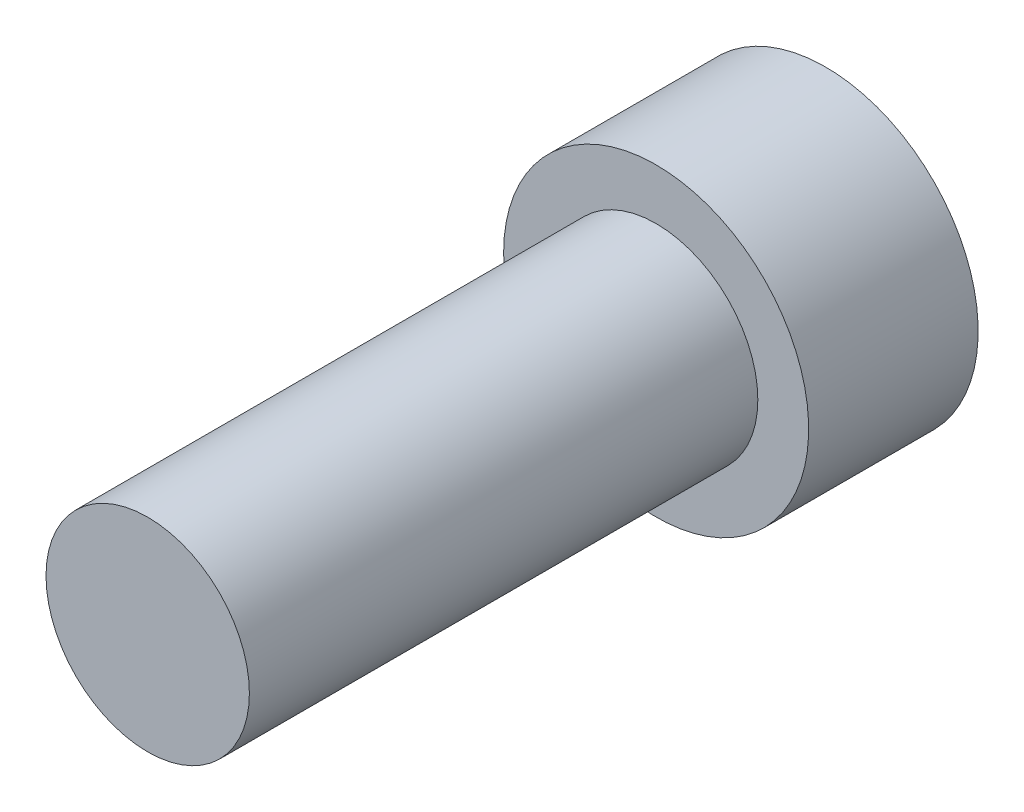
ISO-10303-21;
HEADER;
FILE_DESCRIPTION(('STEP AP214'),'2;1');
FILE_NAME('part.step','',(''),(''),'','','');
FILE_SCHEMA(('AUTOMOTIVE_DESIGN { 1 0 10303 214 1 1 1 1 }'));
ENDSEC;
DATA;
#1=APPLICATION_CONTEXT('core data for automotive mechanical design processes');
#2=APPLICATION_PROTOCOL_DEFINITION('international standard','automotive_design',2000,#1);
#3=PRODUCT_CONTEXT('',#1,'mechanical');
#4=PRODUCT('Part','Part','',(#3));
#5=PRODUCT_RELATED_PRODUCT_CATEGORY('part','',(#4));
#6=PRODUCT_DEFINITION_FORMATION('','',#4);
#7=PRODUCT_DEFINITION_CONTEXT('part definition',#1,'design');
#8=PRODUCT_DEFINITION('design','',#6,#7);
#9=PRODUCT_DEFINITION_SHAPE('','',#8);
#10=(LENGTH_UNIT() NAMED_UNIT(*) SI_UNIT(.MILLI.,.METRE.));
#11=(NAMED_UNIT(*) PLANE_ANGLE_UNIT() SI_UNIT($,.RADIAN.));
#12=(NAMED_UNIT(*) SI_UNIT($,.STERADIAN.) SOLID_ANGLE_UNIT());
#13=UNCERTAINTY_MEASURE_WITH_UNIT(LENGTH_MEASURE(1.E-05),#10,'distance_accuracy_value','');
#14=(GEOMETRIC_REPRESENTATION_CONTEXT(3) GLOBAL_UNCERTAINTY_ASSIGNED_CONTEXT((#13)) GLOBAL_UNIT_ASSIGNED_CONTEXT((#10,
#11,#12)) REPRESENTATION_CONTEXT('',''));
#15=CARTESIAN_POINT('',(0.,0.,0.));
#16=DIRECTION('',(0.,0.,1.));
#17=DIRECTION('',(1.,0.,0.));
#18=AXIS2_PLACEMENT_3D('',#15,#16,#17);
#19=CARTESIAN_POINT('',(0.,0.,-5.));
#20=DIRECTION('',(0.,0.,-1.));
#21=DIRECTION('',(-1.,0.,0.));
#22=AXIS2_PLACEMENT_3D('',#19,#20,#21);
#23=PLANE('',#22);
#24=CARTESIAN_POINT('',(0.,0.,-5.));
#25=DIRECTION('',(0.,0.,-1.));
#26=DIRECTION('',(-1.,0.,0.));
#27=AXIS2_PLACEMENT_3D('',#24,#25,#26);
#28=CIRCLE('',#27,4.5);
#29=CARTESIAN_POINT('',(-4.5,0.,-5.));
#30=VERTEX_POINT('',#29);
#31=EDGE_CURVE('E118',#30,#30,#28,.T.);
#32=ORIENTED_EDGE('',*,*,#31,.T.);
#33=EDGE_LOOP('',(#32));
#34=FACE_BOUND('',#33,.T.);
#35=DIRECTION('',(0.,-1.,0.));
#36=VECTOR('',#35,1.);
#37=CARTESIAN_POINT('',(-3.,1.73205080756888,-5.));
#38=LINE('',#37,#36);
#39=CARTESIAN_POINT('',(-3.,1.73205080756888,-5.));
#40=VERTEX_POINT('',#39);
#41=CARTESIAN_POINT('',(-3.,-1.73205080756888,-5.));
#42=VERTEX_POINT('',#41);
#43=EDGE_CURVE('E102',#40,#42,#38,.T.);
#44=ORIENTED_EDGE('',*,*,#43,.T.);
#45=DIRECTION('',(0.866025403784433,-0.50000000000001,0.));
#46=VECTOR('',#45,1.);
#47=CARTESIAN_POINT('',(-3.00000000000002,-1.73205080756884,-5.));
#48=LINE('',#47,#46);
#49=CARTESIAN_POINT('',(0.,-3.46410161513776,-5.));
#50=VERTEX_POINT('',#49);
#51=EDGE_CURVE('E85',#42,#50,#48,.T.);
#52=ORIENTED_EDGE('',*,*,#51,.T.);
#53=DIRECTION('',(0.866025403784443,0.499999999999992,0.));
#54=VECTOR('',#53,1.);
#55=CARTESIAN_POINT('',(0.,-3.46410161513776,-5.));
#56=LINE('',#55,#54);
#57=CARTESIAN_POINT('',(2.99999999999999,-1.7320508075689,-5.));
#58=VERTEX_POINT('',#57);
#59=EDGE_CURVE('E262',#50,#58,#56,.T.);
#60=ORIENTED_EDGE('',*,*,#59,.T.);
#61=DIRECTION('',(0.,1.,0.));
#62=VECTOR('',#61,1.);
#63=CARTESIAN_POINT('',(2.99999999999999,-1.7320508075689,-5.));
#64=LINE('',#63,#62);
#65=CARTESIAN_POINT('',(3.00000000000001,1.73205080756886,-5.));
#66=VERTEX_POINT('',#65);
#67=EDGE_CURVE('E264',#58,#66,#64,.T.);
#68=ORIENTED_EDGE('',*,*,#67,.T.);
#69=DIRECTION('',(-0.866025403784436,0.500000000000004,0.));
#70=VECTOR('',#69,1.);
#71=CARTESIAN_POINT('',(3.00000000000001,1.73205080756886,-5.));
#72=LINE('',#71,#70);
#73=CARTESIAN_POINT('',(0.,3.46410161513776,-5.));
#74=VERTEX_POINT('',#73);
#75=EDGE_CURVE('E275',#66,#74,#72,.T.);
#76=ORIENTED_EDGE('',*,*,#75,.T.);
#77=DIRECTION('',(-0.86602540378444,-0.499999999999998,0.));
#78=VECTOR('',#77,1.);
#79=CARTESIAN_POINT('',(0.,3.46410161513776,-5.));
#80=LINE('',#79,#78);
#81=EDGE_CURVE('E107',#74,#40,#80,.T.);
#82=ORIENTED_EDGE('',*,*,#81,.T.);
#83=EDGE_LOOP('',(#44,#52,#60,#68,#76,#82));
#84=FACE_BOUND('',#83,.T.);
#85=ADVANCED_FACE('F34',(#34,#84),#23,.T.);
#86=CARTESIAN_POINT('',(-3.,1.73205080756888,-1.));
#87=DIRECTION('',(1.,0.,0.));
#88=DIRECTION('',(0.,0.,-1.));
#89=AXIS2_PLACEMENT_3D('',#86,#87,#88);
#90=PLANE('',#89);
#91=DIRECTION('',(0.,-1.,0.));
#92=VECTOR('',#91,1.);
#93=CARTESIAN_POINT('',(-3.,1.73205080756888,-1.));
#94=LINE('',#93,#92);
#95=CARTESIAN_POINT('',(-3.,1.73205080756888,-1.));
#96=VERTEX_POINT('',#95);
#97=CARTESIAN_POINT('',(-3.,-1.73205080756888,-1.));
#98=VERTEX_POINT('',#97);
#99=EDGE_CURVE('E104',#96,#98,#94,.T.);
#100=ORIENTED_EDGE('',*,*,#99,.T.);
#101=DIRECTION('',(0.,0.,-1.));
#102=VECTOR('',#101,1.);
#103=CARTESIAN_POINT('',(-3.,-1.73205080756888,-1.));
#104=LINE('',#103,#102);
#105=EDGE_CURVE('E89',#98,#42,#104,.T.);
#106=ORIENTED_EDGE('',*,*,#105,.T.);
#107=ORIENTED_EDGE('',*,*,#43,.F.);
#108=DIRECTION('',(0.,0.,-1.));
#109=VECTOR('',#108,1.);
#110=CARTESIAN_POINT('',(-3.,1.73205080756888,-1.));
#111=LINE('',#110,#109);
#112=EDGE_CURVE('E49',#96,#40,#111,.T.);
#113=ORIENTED_EDGE('',*,*,#112,.F.);
#114=EDGE_LOOP('',(#100,#106,#107,#113));
#115=FACE_BOUND('',#114,.T.);
#116=ADVANCED_FACE('F101',(#115),#90,.T.);
#117=CARTESIAN_POINT('',(0.,0.,-1.));
#118=DIRECTION('',(0.,0.,1.));
#119=DIRECTION('',(1.,0.,0.));
#120=AXIS2_PLACEMENT_3D('',#117,#118,#119);
#121=PLANE('',#120);
#122=DIRECTION('',(0.866025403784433,-0.50000000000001,0.));
#123=VECTOR('',#122,1.);
#124=CARTESIAN_POINT('',(-3.00000000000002,-1.73205080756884,-1.));
#125=LINE('',#124,#123);
#126=CARTESIAN_POINT('',(0.,-3.46410161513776,-1.));
#127=VERTEX_POINT('',#126);
#128=EDGE_CURVE('E96',#98,#127,#125,.T.);
#129=ORIENTED_EDGE('',*,*,#128,.F.);
#130=ORIENTED_EDGE('',*,*,#99,.F.);
#131=DIRECTION('',(-0.86602540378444,-0.499999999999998,0.));
#132=VECTOR('',#131,1.);
#133=CARTESIAN_POINT('',(0.,3.46410161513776,-1.));
#134=LINE('',#133,#132);
#135=CARTESIAN_POINT('',(0.,3.46410161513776,-1.));
#136=VERTEX_POINT('',#135);
#137=EDGE_CURVE('E110',#136,#96,#134,.T.);
#138=ORIENTED_EDGE('',*,*,#137,.F.);
#139=DIRECTION('',(-0.866025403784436,0.500000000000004,0.));
#140=VECTOR('',#139,1.);
#141=CARTESIAN_POINT('',(3.00000000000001,1.73205080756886,-1.));
#142=LINE('',#141,#140);
#143=CARTESIAN_POINT('',(3.00000000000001,1.73205080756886,-1.));
#144=VERTEX_POINT('',#143);
#145=EDGE_CURVE('E277',#144,#136,#142,.T.);
#146=ORIENTED_EDGE('',*,*,#145,.F.);
#147=DIRECTION('',(0.,1.,0.));
#148=VECTOR('',#147,1.);
#149=CARTESIAN_POINT('',(2.99999999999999,-1.7320508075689,-1.));
#150=LINE('',#149,#148);
#151=CARTESIAN_POINT('',(2.99999999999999,-1.7320508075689,-1.));
#152=VERTEX_POINT('',#151);
#153=EDGE_CURVE('E271',#152,#144,#150,.T.);
#154=ORIENTED_EDGE('',*,*,#153,.F.);
#155=DIRECTION('',(0.866025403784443,0.499999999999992,0.));
#156=VECTOR('',#155,1.);
#157=CARTESIAN_POINT('',(0.,-3.46410161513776,-1.));
#158=LINE('',#157,#156);
#159=EDGE_CURVE('E258',#127,#152,#158,.T.);
#160=ORIENTED_EDGE('',*,*,#159,.F.);
#161=EDGE_LOOP('',(#129,#130,#138,#146,#154,#160));
#162=FACE_BOUND('',#161,.T.);
#163=ADVANCED_FACE('F142',(#162),#121,.F.);
#164=CARTESIAN_POINT('',(0.,0.,15.));
#165=DIRECTION('',(0.,0.,-1.));
#166=DIRECTION('',(-1.,0.,0.));
#167=AXIS2_PLACEMENT_3D('',#164,#165,#166);
#168=CYLINDRICAL_SURFACE('',#167,3.);
#169=CARTESIAN_POINT('',(0.,0.,15.));
#170=DIRECTION('',(0.,0.,1.));
#171=DIRECTION('',(1.,0.,0.));
#172=AXIS2_PLACEMENT_3D('',#169,#170,#171);
#173=CIRCLE('',#172,3.);
#174=CARTESIAN_POINT('',(3.,0.,15.));
#175=VERTEX_POINT('',#174);
#176=EDGE_CURVE('E11',#175,#175,#173,.T.);
#177=ORIENTED_EDGE('',*,*,#176,.F.);
#178=EDGE_LOOP('',(#177));
#179=FACE_BOUND('',#178,.T.);
#180=CARTESIAN_POINT('',(0.,0.,0.));
#181=DIRECTION('',(0.,0.,1.));
#182=DIRECTION('',(1.,0.,0.));
#183=AXIS2_PLACEMENT_3D('',#180,#181,#182);
#184=CIRCLE('',#183,3.);
#185=CARTESIAN_POINT('',(3.,0.,0.));
#186=VERTEX_POINT('',#185);
#187=EDGE_CURVE('E42',#186,#186,#184,.T.);
#188=ORIENTED_EDGE('',*,*,#187,.T.);
#189=EDGE_LOOP('',(#188));
#190=FACE_BOUND('',#189,.T.);
#191=ADVANCED_FACE('F36',(#179,#190),#168,.T.);
#192=CARTESIAN_POINT('',(0.,0.,15.));
#193=DIRECTION('',(0.,0.,1.));
#194=DIRECTION('',(1.,0.,0.));
#195=AXIS2_PLACEMENT_3D('',#192,#193,#194);
#196=PLANE('',#195);
#197=ORIENTED_EDGE('',*,*,#176,.T.);
#198=EDGE_LOOP('',(#197));
#199=FACE_BOUND('',#198,.T.);
#200=ADVANCED_FACE('F132',(#199),#196,.T.);
#201=CARTESIAN_POINT('',(0.,0.,-5.));
#202=DIRECTION('',(0.,0.,1.));
#203=DIRECTION('',(1.,0.,0.));
#204=AXIS2_PLACEMENT_3D('',#201,#202,#203);
#205=CYLINDRICAL_SURFACE('',#204,4.5);
#206=ORIENTED_EDGE('',*,*,#31,.F.);
#207=EDGE_LOOP('',(#206));
#208=FACE_BOUND('',#207,.T.);
#209=CARTESIAN_POINT('',(0.,0.,0.));
#210=DIRECTION('',(0.,0.,-1.));
#211=DIRECTION('',(-1.,0.,0.));
#212=AXIS2_PLACEMENT_3D('',#209,#210,#211);
#213=CIRCLE('',#212,4.5);
#214=CARTESIAN_POINT('',(-4.5,0.,0.));
#215=VERTEX_POINT('',#214);
#216=EDGE_CURVE('E115',#215,#215,#213,.T.);
#217=ORIENTED_EDGE('',*,*,#216,.T.);
#218=EDGE_LOOP('',(#217));
#219=FACE_BOUND('',#218,.T.);
#220=ADVANCED_FACE('F127',(#208,#219),#205,.T.);
#221=CARTESIAN_POINT('',(0.,0.,0.));
#222=DIRECTION('',(0.,0.,-1.));
#223=DIRECTION('',(-1.,0.,0.));
#224=AXIS2_PLACEMENT_3D('',#221,#222,#223);
#225=PLANE('',#224);
#226=ORIENTED_EDGE('',*,*,#187,.F.);
#227=EDGE_LOOP('',(#226));
#228=FACE_BOUND('',#227,.T.);
#229=ORIENTED_EDGE('',*,*,#216,.F.);
#230=EDGE_LOOP('',(#229));
#231=FACE_BOUND('',#230,.T.);
#232=ADVANCED_FACE('F124',(#228,#231),#225,.F.);
#233=CARTESIAN_POINT('',(-3.00000000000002,-1.73205080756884,-1.));
#234=DIRECTION('',(0.50000000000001,0.866025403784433,0.));
#235=DIRECTION('',(-0.866025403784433,0.50000000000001,0.));
#236=AXIS2_PLACEMENT_3D('',#233,#234,#235);
#237=PLANE('',#236);
#238=ORIENTED_EDGE('',*,*,#128,.T.);
#239=DIRECTION('',(0.,0.,-1.));
#240=VECTOR('',#239,1.);
#241=CARTESIAN_POINT('',(0.,-3.46410161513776,-1.));
#242=LINE('',#241,#240);
#243=EDGE_CURVE('E91',#127,#50,#242,.T.);
#244=ORIENTED_EDGE('',*,*,#243,.T.);
#245=ORIENTED_EDGE('',*,*,#51,.F.);
#246=ORIENTED_EDGE('',*,*,#105,.F.);
#247=EDGE_LOOP('',(#238,#244,#245,#246));
#248=FACE_BOUND('',#247,.T.);
#249=ADVANCED_FACE('F88',(#248),#237,.T.);
#250=CARTESIAN_POINT('',(0.,-3.46410161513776,-1.));
#251=DIRECTION('',(-0.499999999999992,0.866025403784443,0.));
#252=DIRECTION('',(-0.866025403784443,-0.499999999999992,0.));
#253=AXIS2_PLACEMENT_3D('',#250,#251,#252);
#254=PLANE('',#253);
#255=ORIENTED_EDGE('',*,*,#159,.T.);
#256=DIRECTION('',(0.,0.,-1.));
#257=VECTOR('',#256,1.);
#258=CARTESIAN_POINT('',(2.99999999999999,-1.7320508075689,-1.));
#259=LINE('',#258,#257);
#260=EDGE_CURVE('E260',#152,#58,#259,.T.);
#261=ORIENTED_EDGE('',*,*,#260,.T.);
#262=ORIENTED_EDGE('',*,*,#59,.F.);
#263=ORIENTED_EDGE('',*,*,#243,.F.);
#264=EDGE_LOOP('',(#255,#261,#262,#263));
#265=FACE_BOUND('',#264,.T.);
#266=ADVANCED_FACE('F166',(#265),#254,.T.);
#267=CARTESIAN_POINT('',(2.99999999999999,-1.7320508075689,-1.));
#268=DIRECTION('',(-1.,0.,0.));
#269=DIRECTION('',(0.,-1.,0.));
#270=AXIS2_PLACEMENT_3D('',#267,#268,#269);
#271=PLANE('',#270);
#272=ORIENTED_EDGE('',*,*,#153,.T.);
#273=DIRECTION('',(0.,0.,-1.));
#274=VECTOR('',#273,1.);
#275=CARTESIAN_POINT('',(3.00000000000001,1.73205080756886,-1.));
#276=LINE('',#275,#274);
#277=EDGE_CURVE('E279',#144,#66,#276,.T.);
#278=ORIENTED_EDGE('',*,*,#277,.T.);
#279=ORIENTED_EDGE('',*,*,#67,.F.);
#280=ORIENTED_EDGE('',*,*,#260,.F.);
#281=EDGE_LOOP('',(#272,#278,#279,#280));
#282=FACE_BOUND('',#281,.T.);
#283=ADVANCED_FACE('F162',(#282),#271,.T.);
#284=CARTESIAN_POINT('',(3.00000000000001,1.73205080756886,-1.));
#285=DIRECTION('',(-0.500000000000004,-0.866025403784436,0.));
#286=DIRECTION('',(0.866025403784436,-0.500000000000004,0.));
#287=AXIS2_PLACEMENT_3D('',#284,#285,#286);
#288=PLANE('',#287);
#289=ORIENTED_EDGE('',*,*,#145,.T.);
#290=DIRECTION('',(0.,0.,-1.));
#291=VECTOR('',#290,1.);
#292=CARTESIAN_POINT('',(0.,3.46410161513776,-1.));
#293=LINE('',#292,#291);
#294=EDGE_CURVE('E54',#136,#74,#293,.T.);
#295=ORIENTED_EDGE('',*,*,#294,.T.);
#296=ORIENTED_EDGE('',*,*,#75,.F.);
#297=ORIENTED_EDGE('',*,*,#277,.F.);
#298=EDGE_LOOP('',(#289,#295,#296,#297));
#299=FACE_BOUND('',#298,.T.);
#300=ADVANCED_FACE('F159',(#299),#288,.T.);
#301=CARTESIAN_POINT('',(0.,3.46410161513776,-1.));
#302=DIRECTION('',(0.499999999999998,-0.86602540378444,0.));
#303=DIRECTION('',(0.86602540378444,0.499999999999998,0.));
#304=AXIS2_PLACEMENT_3D('',#301,#302,#303);
#305=PLANE('',#304);
#306=ORIENTED_EDGE('',*,*,#137,.T.);
#307=ORIENTED_EDGE('',*,*,#112,.T.);
#308=ORIENTED_EDGE('',*,*,#81,.F.);
#309=ORIENTED_EDGE('',*,*,#294,.F.);
#310=EDGE_LOOP('',(#306,#307,#308,#309));
#311=FACE_BOUND('',#310,.T.);
#312=ADVANCED_FACE('F156',(#311),#305,.T.);
#313=CLOSED_SHELL('',(#85,#116,#163,#191,#200,#220,#232,#249,#266,#283,#300,#312));
#314=MANIFOLD_SOLID_BREP('B2',#313);
#315=ADVANCED_BREP_SHAPE_REPRESENTATION('',(#18,#314),#14);
#316=SHAPE_DEFINITION_REPRESENTATION(#9,#315);
ENDSEC;
END-ISO-10303-21;
